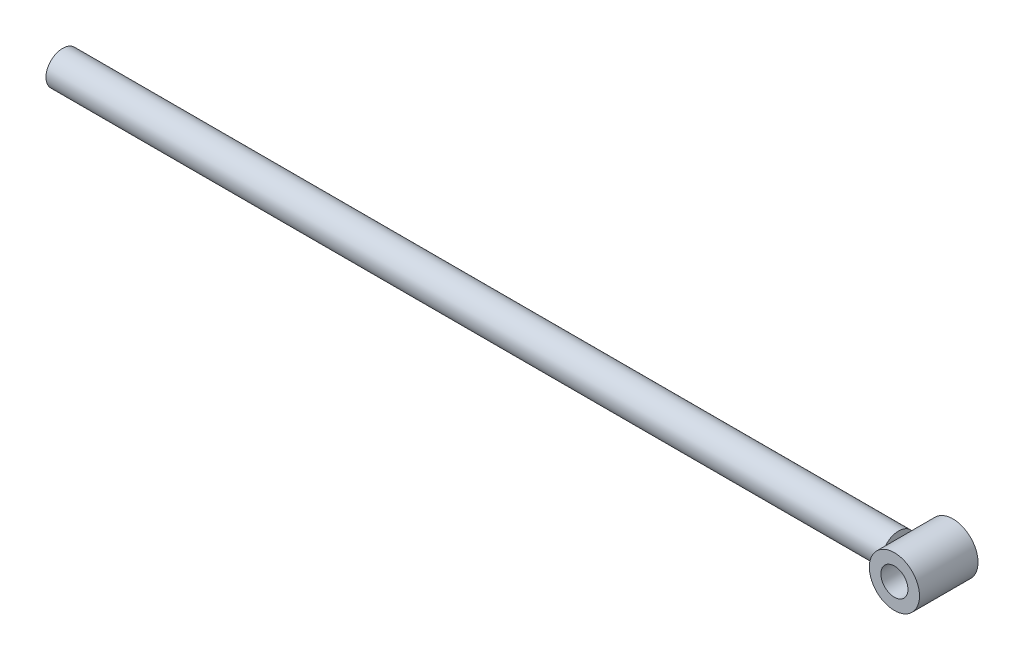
from build123d import *

# Parameters (mm, degrees)
ESQUISSE1_R      = 10
EXTRUSION1_DEPTH = 500
ESQUISSE2_R      = 15
ESQUISSE2_R_2    = 8.1
EXTRUSION2_DEPTH = 17.5


with BuildPart() as part:
    # Esquisse1 → Extrusion1 (new body)
    with BuildSketch(Plane(origin=(0, 0, 0), x_dir=(0, 0, -1), z_dir=(1, 0, 0))):
        Circle(ESQUISSE1_R)
    extrude(amount=EXTRUSION1_DEPTH)


with BuildPart() as body_2:
    # Esquisse2 → Extrusion2 (new, symmetric)
    with BuildSketch(Plane.XY):
        with Locations((515, 0)):
            Circle(ESQUISSE2_R)
        with Locations((515, 0)):
            Circle(ESQUISSE2_R_2, mode=Mode.SUBTRACT)
    extrude(amount=EXTRUSION2_DEPTH, both=True)


solid = Compound([part.part, body_2.part])
